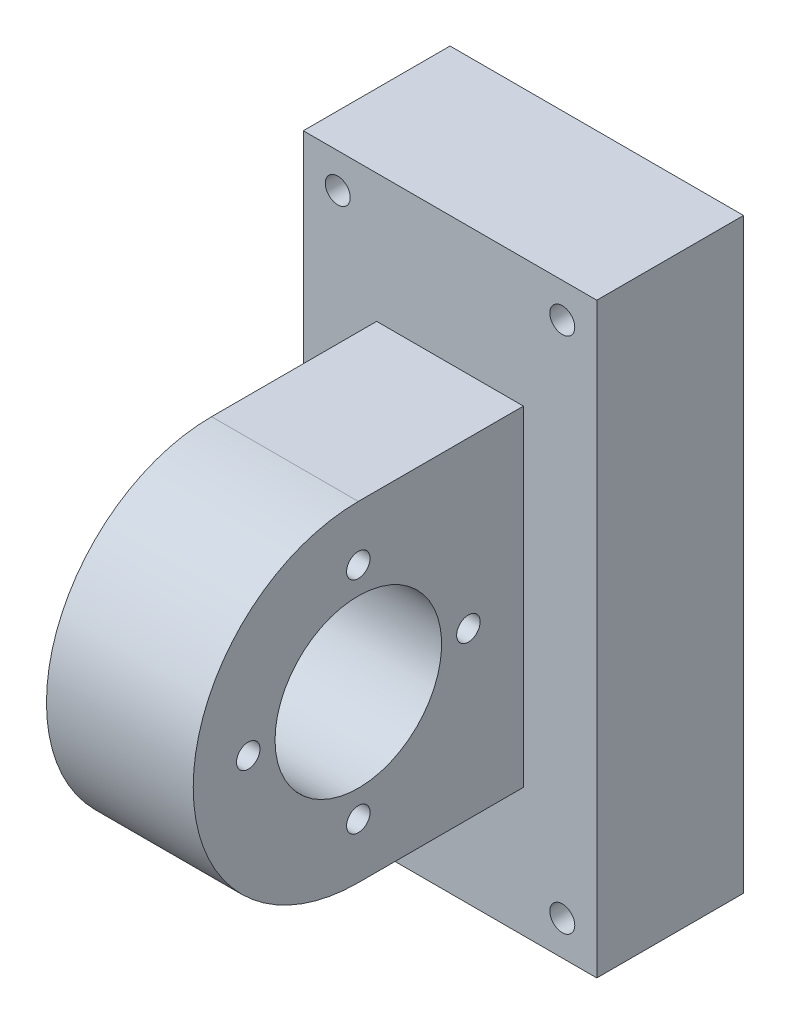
from build123d import *

# Parameters (mm, degrees)
SKETCH1_W                = 20
SKETCH1_H                = 80
BOSS_EXTRUDE1_DEPTH      = 20
SKETCH12_R               = 1.7
CUT_EXTRUDE1_DEPTH       = 46.82575695
MIRROR3_COPY_1_SKETCH_R  = 1.7
MIRROR3_COPY_1_DEPTH     = 46.82575695
BOSS_EXTRUDE2_DEPTH      = 10
BOSS_EXTRUDE2_DEPTH_BACK = 10
SKETCH8_R                = 11.35
SKETCH14_R               = 1.6
CUT_EXTRUDE2_DEPTH       = 20
CIRPATTERN2_COUNT        = 4


with BuildPart() as part:
    # Sketch1 → Boss-Extrude1 (new body)
    with BuildSketch(Plane.XY):
        Rectangle(SKETCH1_W, SKETCH1_H)
    boss_extrude1 = extrude(amount=BOSS_EXTRUDE1_DEPTH)

    # Sketch12 → Cut-Extrude1 (cut, through all)
    with BuildSketch(Plane.XY.offset(20)):
        with Locations((5.3, 35.3)):
            Circle(SKETCH12_R)
    cut_extrude1 = extrude(amount=-CUT_EXTRUDE1_DEPTH, mode=Mode.SUBTRACT)

    # Mirror1: Cut-Extrude1 across plane
    add(cut_extrude1.mirror(Plane(origin=(0, 0, 0), x_dir=(0, 0, 1), z_dir=(0, -1, 0))), mode=Mode.SUBTRACT)

    # Mirror3: Boss-Extrude1, Cut-Extrude1 across plane
    add(boss_extrude1.mirror(Plane.ZY.offset(10)))
    add(cut_extrude1.mirror(Plane.ZY.offset(10)), mode=Mode.SUBTRACT)

    # Mirror3 copy 1 sketch → Mirror3 copy 1 (cut, through all)
    with BuildSketch(Plane(origin=(-20, 0, 20), x_dir=(-1, 0, 0), z_dir=(0, 0, 1))):
        with Locations((5.3, 35.3)):
            Circle(MIRROR3_COPY_1_SKETCH_R)
    extrude(amount=-MIRROR3_COPY_1_DEPTH, mode=Mode.SUBTRACT)

    # Sketch8 → Boss-Extrude2 (add, two sides: drawn at the far end of the back side and taken through both)
    with BuildSketch(Plane.ZY.offset(10).offset(-BOSS_EXTRUDE2_DEPTH_BACK)):
        with BuildLine():
            Line((20, 22.5), (20, -22.5))
            Line((20, -22.5), (42.5, -22.5))
            ThreePointArc((42.5, -22.5), (65, 0), (42.5, 22.5))
            Line((42.5, 22.5), (20, 22.5))
        make_face()
        with Locations((42.5, 0)):
            Circle(SKETCH8_R, mode=Mode.SUBTRACT)
    extrude(amount=BOSS_EXTRUDE2_DEPTH + BOSS_EXTRUDE2_DEPTH_BACK)

    # Sketch14 → Cut-Extrude2 (cut)
    with BuildSketch(Plane(origin=(0, 0, 0), x_dir=(0, 0, -1), z_dir=(1, 0, 0))):
        with Locations((-57.5, 0)):
            Circle(SKETCH14_R)
    cut_extrude2 = extrude(amount=-CUT_EXTRUDE2_DEPTH, mode=Mode.SUBTRACT)

    # CirPattern2: Cut-Extrude2 ×4 about axis
    cirpattern2_axis = Axis((0, 0, 42.5), (1, 0, 0))
    for i in range(1, CIRPATTERN2_COUNT):
        add(cut_extrude2.rotate(cirpattern2_axis, i * 360 / CIRPATTERN2_COUNT), mode=Mode.SUBTRACT)


solid = part.part
